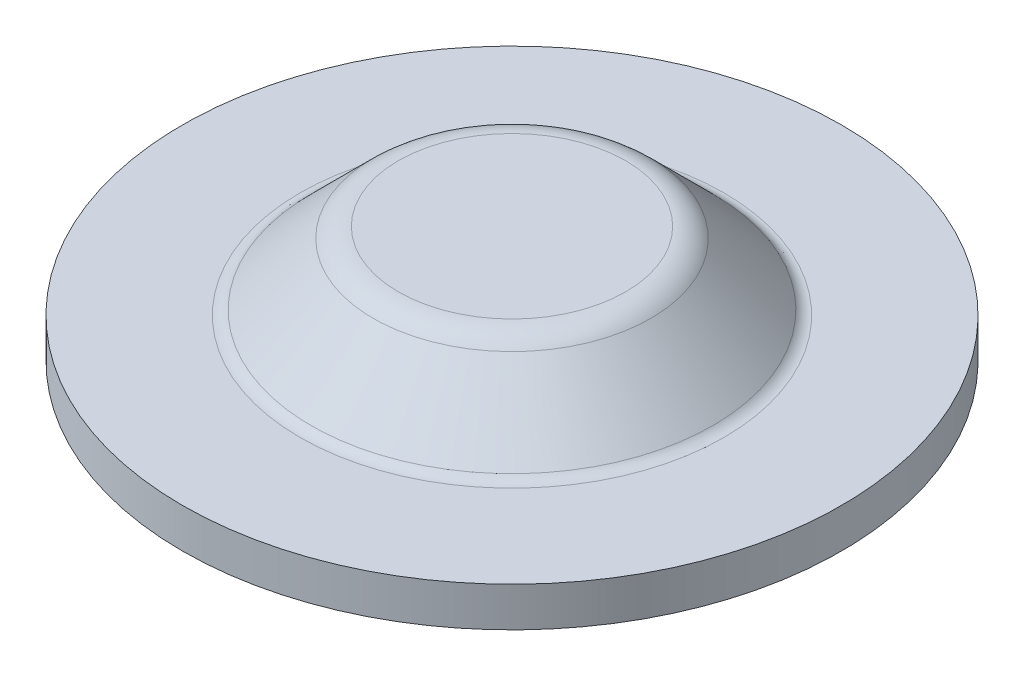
ISO-10303-21;
HEADER;
FILE_DESCRIPTION(('STEP AP214'),'2;1');
FILE_NAME('part.step','',(''),(''),'','','');
FILE_SCHEMA(('AUTOMOTIVE_DESIGN { 1 0 10303 214 1 1 1 1 }'));
ENDSEC;
DATA;
#1=APPLICATION_CONTEXT('core data for automotive mechanical design processes');
#2=APPLICATION_PROTOCOL_DEFINITION('international standard','automotive_design',2000,#1);
#3=PRODUCT_CONTEXT('',#1,'mechanical');
#4=PRODUCT('Part','Part','',(#3));
#5=PRODUCT_RELATED_PRODUCT_CATEGORY('part','',(#4));
#6=PRODUCT_DEFINITION_FORMATION('','',#4);
#7=PRODUCT_DEFINITION_CONTEXT('part definition',#1,'design');
#8=PRODUCT_DEFINITION('design','',#6,#7);
#9=PRODUCT_DEFINITION_SHAPE('','',#8);
#10=(LENGTH_UNIT() NAMED_UNIT(*) SI_UNIT(.MILLI.,.METRE.));
#11=(NAMED_UNIT(*) PLANE_ANGLE_UNIT() SI_UNIT($,.RADIAN.));
#12=(NAMED_UNIT(*) SI_UNIT($,.STERADIAN.) SOLID_ANGLE_UNIT());
#13=UNCERTAINTY_MEASURE_WITH_UNIT(LENGTH_MEASURE(1.E-05),#10,'distance_accuracy_value','');
#14=(GEOMETRIC_REPRESENTATION_CONTEXT(3) GLOBAL_UNCERTAINTY_ASSIGNED_CONTEXT((#13)) GLOBAL_UNIT_ASSIGNED_CONTEXT((#10,
#11,#12)) REPRESENTATION_CONTEXT('',''));
#15=CARTESIAN_POINT('',(0.,0.,0.));
#16=DIRECTION('',(0.,0.,1.));
#17=DIRECTION('',(1.,0.,0.));
#18=AXIS2_PLACEMENT_3D('',#15,#16,#17);
#19=CARTESIAN_POINT('',(-5.39479231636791,1.8034,0.));
#20=DIRECTION('',(0.,1.,0.));
#21=DIRECTION('',(0.,0.,1.));
#22=AXIS2_PLACEMENT_3D('',#19,#20,#21);
#23=PLANE('',#22);
#24=CARTESIAN_POINT('',(0.,1.8034,0.));
#25=DIRECTION('',(0.,-1.,0.));
#26=DIRECTION('',(1.,0.,0.));
#27=AXIS2_PLACEMENT_3D('',#24,#25,#26);
#28=CIRCLE('',#27,5.39479231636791);
#29=CARTESIAN_POINT('',(5.39479231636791,1.8034,0.));
#30=VERTEX_POINT('',#29);
#31=EDGE_CURVE('E118',#30,#30,#28,.T.);
#32=ORIENTED_EDGE('',*,*,#31,.T.);
#33=EDGE_LOOP('',(#32));
#34=FACE_BOUND('',#33,.T.);
#35=ADVANCED_FACE('F18',(#34),#23,.F.);
#36=CARTESIAN_POINT('',(0.,-1.12385378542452,0.));
#37=DIRECTION('',(0.,-1.,0.));
#38=DIRECTION('',(1.,0.,0.));
#39=AXIS2_PLACEMENT_3D('',#36,#37,#38);
#40=CONICAL_SURFACE('',#39,8.32204610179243,0.785398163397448);
#41=ORIENTED_EDGE('',*,*,#31,.F.);
#42=EDGE_LOOP('',(#41));
#43=FACE_BOUND('',#42,.T.);
#44=CARTESIAN_POINT('',(0.,-1.12385378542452,0.));
#45=DIRECTION('',(0.,-1.,0.));
#46=DIRECTION('',(0.,0.,-1.));
#47=AXIS2_PLACEMENT_3D('',#44,#45,#46);
#48=CIRCLE('',#47,8.32204610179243);
#49=CARTESIAN_POINT('',(0.,-1.12385378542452,-8.32204610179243));
#50=VERTEX_POINT('',#49);
#51=EDGE_CURVE('E109',#50,#50,#48,.F.);
#52=ORIENTED_EDGE('',*,*,#51,.F.);
#53=EDGE_LOOP('',(#52));
#54=FACE_BOUND('',#53,.T.);
#55=ADVANCED_FACE('F88',(#43,#54),#40,.F.);
#56=CARTESIAN_POINT('',(-5.4737,3.7084,0.));
#57=DIRECTION('',(0.,-1.,0.));
#58=DIRECTION('',(0.,0.,-1.));
#59=AXIS2_PLACEMENT_3D('',#56,#57,#58);
#60=PLANE('',#59);
#61=CARTESIAN_POINT('',(0.,3.7084,0.));
#62=DIRECTION('',(0.,-1.,0.));
#63=DIRECTION('',(0.,0.,1.));
#64=AXIS2_PLACEMENT_3D('',#61,#62,#63);
#65=CIRCLE('',#64,5.4737);
#66=CARTESIAN_POINT('',(0.,3.7084,5.4737));
#67=VERTEX_POINT('',#66);
#68=CARTESIAN_POINT('',(0.,3.7084,-5.4737));
#69=VERTEX_POINT('',#68);
#70=EDGE_CURVE('E117',#67,#69,#65,.T.);
#71=ORIENTED_EDGE('',*,*,#70,.F.);
#72=CARTESIAN_POINT('',(0.,3.7084,0.));
#73=DIRECTION('',(0.,-1.,0.));
#74=DIRECTION('',(0.,0.,-1.));
#75=AXIS2_PLACEMENT_3D('',#72,#73,#74);
#76=CIRCLE('',#75,5.4737);
#77=EDGE_CURVE('E56',#69,#67,#76,.T.);
#78=ORIENTED_EDGE('',*,*,#77,.F.);
#79=EDGE_LOOP('',(#71,#78));
#80=FACE_BOUND('',#79,.T.);
#81=ADVANCED_FACE('F81',(#80),#60,.F.);
#82=CARTESIAN_POINT('',(0.,0.762,0.));
#83=DIRECTION('',(0.,-1.,0.));
#84=DIRECTION('',(0.,0.,-1.));
#85=AXIS2_PLACEMENT_3D('',#82,#83,#84);
#86=TOROIDAL_SURFACE('',#85,10.207899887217,2.667);
#87=ORIENTED_EDGE('',*,*,#51,.T.);
#88=EDGE_LOOP('',(#87));
#89=FACE_BOUND('',#88,.T.);
#90=CARTESIAN_POINT('',(0.,-1.905,0.));
#91=DIRECTION('',(0.,-1.,0.));
#92=DIRECTION('',(0.,0.,-1.));
#93=AXIS2_PLACEMENT_3D('',#90,#91,#92);
#94=CIRCLE('',#93,10.207899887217);
#95=CARTESIAN_POINT('',(0.,-1.905,-10.207899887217));
#96=VERTEX_POINT('',#95);
#97=CARTESIAN_POINT('',(0.,-1.905,10.207899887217));
#98=VERTEX_POINT('',#97);
#99=EDGE_CURVE('E49',#96,#98,#94,.T.);
#100=ORIENTED_EDGE('',*,*,#99,.T.);
#101=CARTESIAN_POINT('',(0.,-1.905,0.));
#102=DIRECTION('',(0.,-1.,0.));
#103=DIRECTION('',(0.,0.,1.));
#104=AXIS2_PLACEMENT_3D('',#101,#102,#103);
#105=CIRCLE('',#104,10.207899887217);
#106=EDGE_CURVE('E52',#98,#96,#105,.T.);
#107=ORIENTED_EDGE('',*,*,#106,.T.);
#108=EDGE_LOOP('',(#100,#107));
#109=FACE_BOUND('',#108,.T.);
#110=ADVANCED_FACE('F60',(#89,#109),#86,.T.);
#111=CARTESIAN_POINT('',(0.,1.9939,0.));
#112=DIRECTION('',(0.,-1.,0.));
#113=DIRECTION('',(0.,0.,-1.));
#114=AXIS2_PLACEMENT_3D('',#111,#112,#113);
#115=TOROIDAL_SURFACE('',#114,5.4737,1.7145);
#116=CARTESIAN_POINT('',(0.,3.20623457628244,0.));
#117=DIRECTION('',(0.,-1.,0.));
#118=DIRECTION('',(0.,0.,-1.));
#119=AXIS2_PLACEMENT_3D('',#116,#117,#118);
#120=CIRCLE('',#119,6.68603457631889);
#121=CARTESIAN_POINT('',(0.,3.20623457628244,-6.68603457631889));
#122=VERTEX_POINT('',#121);
#123=EDGE_CURVE('E61',#122,#122,#120,.T.);
#124=ORIENTED_EDGE('',*,*,#123,.F.);
#125=EDGE_LOOP('',(#124));
#126=FACE_BOUND('',#125,.T.);
#127=ORIENTED_EDGE('',*,*,#77,.T.);
#128=ORIENTED_EDGE('',*,*,#70,.T.);
#129=EDGE_LOOP('',(#127,#128));
#130=FACE_BOUND('',#129,.T.);
#131=ADVANCED_FACE('F80',(#126,#130),#115,.T.);
#132=CARTESIAN_POINT('',(-15.875,-1.905,0.));
#133=DIRECTION('',(0.,1.,0.));
#134=DIRECTION('',(0.,0.,1.));
#135=AXIS2_PLACEMENT_3D('',#132,#133,#134);
#136=PLANE('',#135);
#137=CARTESIAN_POINT('',(0.,-1.905,0.));
#138=DIRECTION('',(0.,-1.,0.));
#139=DIRECTION('',(0.,0.,-1.));
#140=AXIS2_PLACEMENT_3D('',#137,#138,#139);
#141=CIRCLE('',#140,15.875);
#142=CARTESIAN_POINT('',(0.,-1.905,-15.875));
#143=VERTEX_POINT('',#142);
#144=EDGE_CURVE('E123',#143,#143,#141,.F.);
#145=ORIENTED_EDGE('',*,*,#144,.F.);
#146=EDGE_LOOP('',(#145));
#147=FACE_BOUND('',#146,.T.);
#148=ORIENTED_EDGE('',*,*,#106,.F.);
#149=ORIENTED_EDGE('',*,*,#99,.F.);
#150=EDGE_LOOP('',(#148,#149));
#151=FACE_BOUND('',#150,.T.);
#152=ADVANCED_FACE('F54',(#147,#151),#136,.F.);
#153=CARTESIAN_POINT('',(0.,0.223184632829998,0.));
#154=DIRECTION('',(0.,-1.,0.));
#155=DIRECTION('',(1.,0.,0.));
#156=AXIS2_PLACEMENT_3D('',#153,#154,#155);
#157=CONICAL_SURFACE('',#156,9.66908451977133,0.785398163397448);
#158=CARTESIAN_POINT('',(0.,0.223184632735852,0.));
#159=DIRECTION('',(0.,-1.,0.));
#160=DIRECTION('',(0.,0.,-1.));
#161=AXIS2_PLACEMENT_3D('',#158,#159,#160);
#162=CIRCLE('',#161,9.66908451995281);
#163=CARTESIAN_POINT('',(0.,0.223184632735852,-9.66908451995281));
#164=VERTEX_POINT('',#163);
#165=EDGE_CURVE('E122',#164,#164,#162,.F.);
#166=ORIENTED_EDGE('',*,*,#165,.T.);
#167=EDGE_LOOP('',(#166));
#168=FACE_BOUND('',#167,.T.);
#169=ORIENTED_EDGE('',*,*,#123,.T.);
#170=EDGE_LOOP('',(#169));
#171=FACE_BOUND('',#170,.T.);
#172=ADVANCED_FACE('F167',(#168,#171),#157,.T.);
#173=CARTESIAN_POINT('',(0.,0.,0.));
#174=DIRECTION('',(0.,-1.,0.));
#175=DIRECTION('',(0.,0.,-1.));
#176=AXIS2_PLACEMENT_3D('',#173,#174,#175);
#177=CYLINDRICAL_SURFACE('',#176,15.875);
#178=ORIENTED_EDGE('',*,*,#144,.T.);
#179=EDGE_LOOP('',(#178));
#180=FACE_BOUND('',#179,.T.);
#181=CARTESIAN_POINT('',(0.,0.,0.));
#182=DIRECTION('',(0.,-1.,0.));
#183=DIRECTION('',(0.,0.,-1.));
#184=AXIS2_PLACEMENT_3D('',#181,#182,#183);
#185=CIRCLE('',#184,15.875);
#186=CARTESIAN_POINT('',(0.,0.,-15.875));
#187=VERTEX_POINT('',#186);
#188=EDGE_CURVE('E119',#187,#187,#185,.T.);
#189=ORIENTED_EDGE('',*,*,#188,.T.);
#190=EDGE_LOOP('',(#189));
#191=FACE_BOUND('',#190,.T.);
#192=ADVANCED_FACE('F147',(#180,#191),#177,.T.);
#193=CARTESIAN_POINT('',(0.,0.762000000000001,0.));
#194=DIRECTION('',(0.,-1.,0.));
#195=DIRECTION('',(0.,0.,-1.));
#196=AXIS2_PLACEMENT_3D('',#193,#194,#195);
#197=TOROIDAL_SURFACE('',#196,10.207899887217,0.762);
#198=CARTESIAN_POINT('',(0.,0.,0.));
#199=DIRECTION('',(0.,1.,0.));
#200=DIRECTION('',(0.,0.,1.));
#201=AXIS2_PLACEMENT_3D('',#198,#199,#200);
#202=CIRCLE('',#201,10.207899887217);
#203=CARTESIAN_POINT('',(0.,0.,10.207899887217));
#204=VERTEX_POINT('',#203);
#205=CARTESIAN_POINT('',(0.,0.,-10.207899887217));
#206=VERTEX_POINT('',#205);
#207=EDGE_CURVE('E11',#204,#206,#202,.T.);
#208=ORIENTED_EDGE('',*,*,#207,.T.);
#209=CARTESIAN_POINT('',(0.,0.,0.));
#210=DIRECTION('',(0.,1.,0.));
#211=DIRECTION('',(0.,0.,-1.));
#212=AXIS2_PLACEMENT_3D('',#209,#210,#211);
#213=CIRCLE('',#212,10.207899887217);
#214=EDGE_CURVE('E29',#206,#204,#213,.T.);
#215=ORIENTED_EDGE('',*,*,#214,.T.);
#216=EDGE_LOOP('',(#208,#215));
#217=FACE_BOUND('',#216,.T.);
#218=ORIENTED_EDGE('',*,*,#165,.F.);
#219=EDGE_LOOP('',(#218));
#220=FACE_BOUND('',#219,.T.);
#221=ADVANCED_FACE('F135',(#217,#220),#197,.F.);
#222=CARTESIAN_POINT('',(-15.875,0.,0.));
#223=DIRECTION('',(0.,-1.,0.));
#224=DIRECTION('',(0.,0.,-1.));
#225=AXIS2_PLACEMENT_3D('',#222,#223,#224);
#226=PLANE('',#225);
#227=ORIENTED_EDGE('',*,*,#214,.F.);
#228=ORIENTED_EDGE('',*,*,#207,.F.);
#229=EDGE_LOOP('',(#227,#228));
#230=FACE_BOUND('',#229,.T.);
#231=ORIENTED_EDGE('',*,*,#188,.F.);
#232=EDGE_LOOP('',(#231));
#233=FACE_BOUND('',#232,.T.);
#234=ADVANCED_FACE('F146',(#230,#233),#226,.F.);
#235=CLOSED_SHELL('',(#35,#55,#81,#110,#131,#152,#172,#192,#221,#234));
#236=MANIFOLD_SOLID_BREP('B1',#235);
#237=ADVANCED_BREP_SHAPE_REPRESENTATION('',(#18,#236),#14);
#238=SHAPE_DEFINITION_REPRESENTATION(#9,#237);
ENDSEC;
END-ISO-10303-21;
